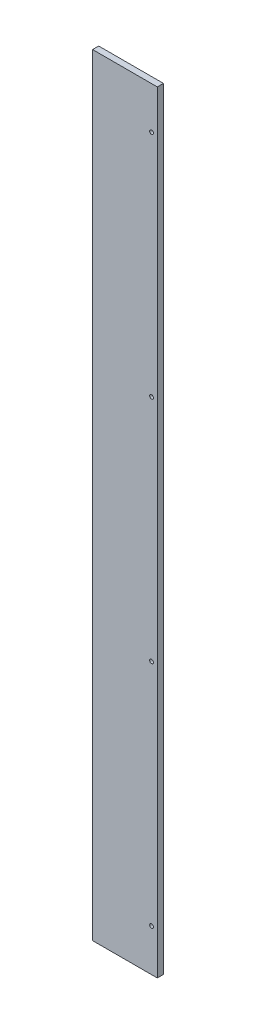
from build123d import *

# Parameters (mm, degrees)
SKETCH_1_W          = 169
SKETCH_1_H          = 2015
EXTRUDE_1_DEPTH     = 8
SKETCH_2_R          = 5
CUT_EXTRUDE_1_DEPTH = 1012.163933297


with BuildPart() as part:
    # Sketch 1 → Extrude 1 (new, symmetric)
    with BuildSketch(Plane.XY):
        Rectangle(SKETCH_1_W, SKETCH_1_H)
    extrude(amount=EXTRUDE_1_DEPTH, both=True)

    # Sketch 2 → Cut-Extrude 1 (cut, through all)
    with BuildSketch(Plane.XY.offset(8)):
        with Locations((69.5, -299.166666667)):
            Circle(SKETCH_2_R)
        with Locations((69.5, 299.166666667)):
            Circle(SKETCH_2_R)
        with Locations((69.5, -897.5)):
            Circle(SKETCH_2_R)
        with Locations((69.5, 897.5)):
            Circle(SKETCH_2_R)
    extrude(amount=-CUT_EXTRUDE_1_DEPTH, mode=Mode.SUBTRACT)


solid = part.part
